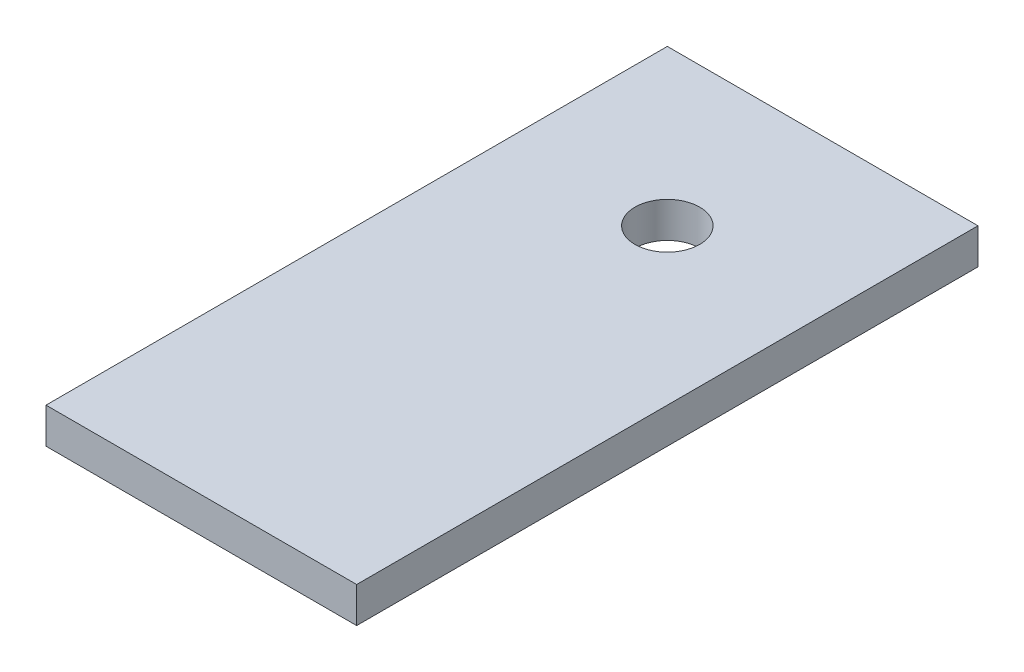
from build123d import *

# Parameters (mm, degrees)
SKETCH1_W           = 152.4
SKETCH1_H           = 17.4625
BOSS_EXTRUDE1_DEPTH = 304.8
SKETCH2_R           = 15.875
CUT_EXTRUDE1_DEPTH  = 315.665566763


with BuildPart() as part:
    # Sketch1 → Boss-Extrude1 (new body)
    with BuildSketch(Plane.XY):
        Rectangle(SKETCH1_W, SKETCH1_H)
    extrude(amount=-BOSS_EXTRUDE1_DEPTH)

    # Sketch2 → Cut-Extrude1 (cut, through all)
    with BuildSketch(Plane(origin=(0, 8.73125, 0), x_dir=(1, 0, 0), z_dir=(0, 1, 0))):
        with Locations(Location((0, 228.6, 0), (0, 0, 270))):
            Circle(SKETCH2_R)
    extrude(amount=-CUT_EXTRUDE1_DEPTH, mode=Mode.SUBTRACT)


solid = part.part
